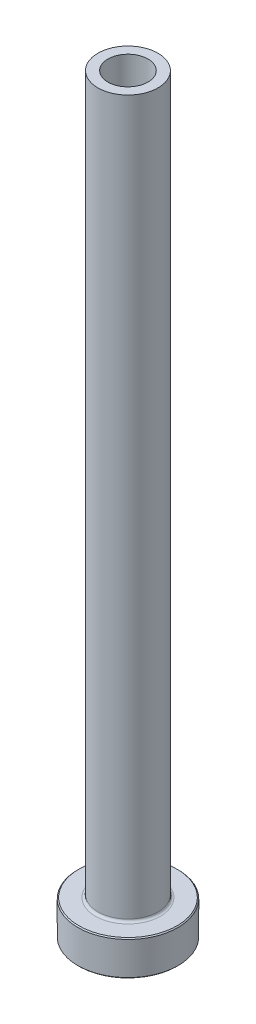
from build123d import *

# Parameters (mm, degrees)
FILLET1_R     = 0.5
CHAMFER1_SIZE = 0.2
CHAMFER3_SIZE = 0.5


with BuildPart() as part:
    # Sketch1 → Revolve1 (revolve)
    with BuildSketch(Plane.XY, mode=Mode.PRIVATE) as revolve1_sk:
        Polygon((-4, 150), (-6, 150), (-6, 7), (-10, 7), (-10, 0), (-4.25, 0), (-4.25, 93), (-4, 105), align=None)
    revolve(revolve1_sk.sketch.rotate(Axis((0, 92.187680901, 0), (0, -1, 0)), 270), axis=Axis((0, 92.187680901, 0), (0, -1, 0)))

    # Fillet1
    fillet1_edges = [part.edges().sort_by_distance(p)[0] for p in [
        (0, 7, -6),
    ]]
    fillet(fillet1_edges, radius=FILLET1_R)

    # Chamfer1
    chamfer1_edges = [part.edges().sort_by_distance(p)[0] for p in [
        (0, 0, -10),
        (0, 7, -10),
    ]]
    chamfer(chamfer1_edges, length=CHAMFER1_SIZE)

    # Chamfer3
    chamfer3_edges = [part.edges().sort_by_distance(p)[0] for p in [
        (0, 0, -4.25),
    ]]
    chamfer(chamfer3_edges, length=CHAMFER3_SIZE)


solid = part.part
